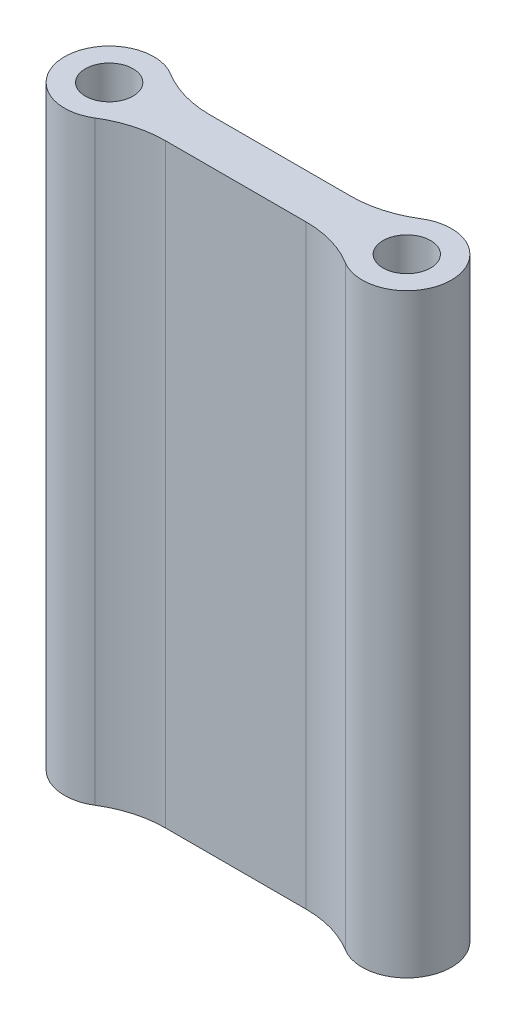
from build123d import *

# Parameters (mm, degrees)
SKETCH_1_R      = 1.6
EXTRUDE_1_DEPTH = 40


with BuildPart() as part:
    # Sketch 1 → Extrude 1 (new body)
    with BuildSketch(Plane(origin=(0, 0, 0), x_dir=(1, 0, 0), z_dir=(0, 1, 0))):
        with BuildLine():
            Line((5.267826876, 1.5), (14.732173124, 1.5))
            ThreePointArc((14.732173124, 1.5), (16.649202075, 1.767615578), (18.419651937, 2.55))
            ThreePointArc((18.419651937, 2.55), (23, 0), (18.419651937, -2.55))
            ThreePointArc((18.419651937, -2.55), (16.649202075, -1.767615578), (14.732173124, -1.5))
            Line((14.732173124, -1.5), (5.267826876, -1.5))
            ThreePointArc((5.267826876, -1.5), (3.350797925, -1.767615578), (1.580348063, -2.55))
            ThreePointArc((1.580348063, -2.55), (-3, 0), (1.580348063, 2.55))
            ThreePointArc((1.580348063, 2.55), (3.350797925, 1.767615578), (5.267826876, 1.5))
        make_face()
        with Locations(Location((0, 0, 0), (0, 0, 270))):
            Circle(SKETCH_1_R, mode=Mode.SUBTRACT)
        with Locations(Location((20, 0, 0), (0, 0, 270))):
            Circle(SKETCH_1_R, mode=Mode.SUBTRACT)
    extrude(amount=EXTRUDE_1_DEPTH)


solid = part.part
